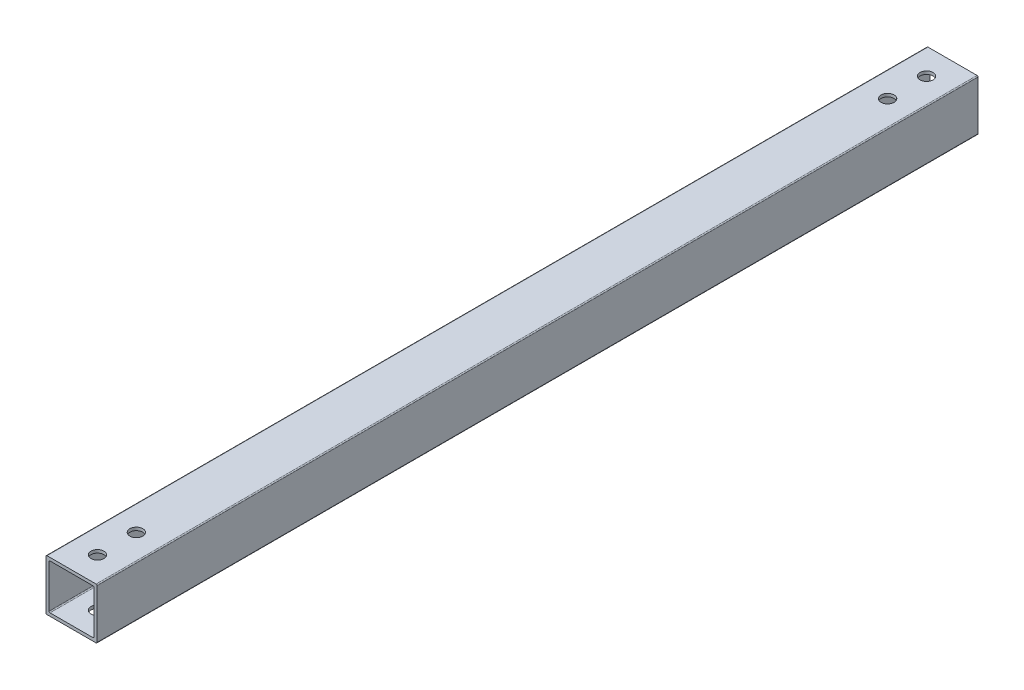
ISO-10303-21;
HEADER;
FILE_DESCRIPTION(('STEP AP214'),'2;1');
FILE_NAME('part.step','',(''),(''),'','','');
FILE_SCHEMA(('AUTOMOTIVE_DESIGN { 1 0 10303 214 1 1 1 1 }'));
ENDSEC;
DATA;
#1=APPLICATION_CONTEXT('core data for automotive mechanical design processes');
#2=APPLICATION_PROTOCOL_DEFINITION('international standard','automotive_design',2000,#1);
#3=PRODUCT_CONTEXT('',#1,'mechanical');
#4=PRODUCT('Part','Part','',(#3));
#5=PRODUCT_RELATED_PRODUCT_CATEGORY('part','',(#4));
#6=PRODUCT_DEFINITION_FORMATION('','',#4);
#7=PRODUCT_DEFINITION_CONTEXT('part definition',#1,'design');
#8=PRODUCT_DEFINITION('design','',#6,#7);
#9=PRODUCT_DEFINITION_SHAPE('','',#8);
#10=(LENGTH_UNIT() NAMED_UNIT(*) SI_UNIT(.MILLI.,.METRE.));
#11=(NAMED_UNIT(*) PLANE_ANGLE_UNIT() SI_UNIT($,.RADIAN.));
#12=(NAMED_UNIT(*) SI_UNIT($,.STERADIAN.) SOLID_ANGLE_UNIT());
#13=UNCERTAINTY_MEASURE_WITH_UNIT(LENGTH_MEASURE(1.E-05),#10,'distance_accuracy_value','');
#14=(GEOMETRIC_REPRESENTATION_CONTEXT(3) GLOBAL_UNCERTAINTY_ASSIGNED_CONTEXT((#13)) GLOBAL_UNIT_ASSIGNED_CONTEXT((#10,
#11,#12)) REPRESENTATION_CONTEXT('',''));
#15=CARTESIAN_POINT('',(0.,0.,0.));
#16=DIRECTION('',(0.,0.,1.));
#17=DIRECTION('',(1.,0.,0.));
#18=AXIS2_PLACEMENT_3D('',#15,#16,#17);
#19=CARTESIAN_POINT('',(-11.9999999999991,-11.9999999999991,-1568.6));
#20=DIRECTION('',(0.,0.,-1.));
#21=DIRECTION('',(-1.,0.,0.));
#22=AXIS2_PLACEMENT_3D('',#19,#20,#21);
#23=CYLINDRICAL_SURFACE('',#22,0.500000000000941);
#24=CARTESIAN_POINT('',(-11.9999999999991,-11.9999999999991,-2000.));
#25=DIRECTION('',(0.,0.,-1.));
#26=DIRECTION('',(-1.,0.,0.));
#27=AXIS2_PLACEMENT_3D('',#24,#25,#26);
#28=CIRCLE('',#27,0.500000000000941);
#29=CARTESIAN_POINT('',(-11.9999999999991,-12.5,-2000.));
#30=VERTEX_POINT('',#29);
#31=CARTESIAN_POINT('',(-12.5,-11.9999999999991,-2000.));
#32=VERTEX_POINT('',#31);
#33=EDGE_CURVE('E213',#30,#32,#28,.T.);
#34=ORIENTED_EDGE('',*,*,#33,.F.);
#35=DIRECTION('',(0.,0.,-1.));
#36=VECTOR('',#35,1.);
#37=CARTESIAN_POINT('',(-11.9999999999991,-12.5,-1568.6));
#38=LINE('',#37,#36);
#39=CARTESIAN_POINT('',(-11.9999999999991,-12.5,-1568.6));
#40=VERTEX_POINT('',#39);
#41=EDGE_CURVE('E11',#40,#30,#38,.T.);
#42=ORIENTED_EDGE('',*,*,#41,.F.);
#43=CARTESIAN_POINT('',(-11.9999999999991,-11.9999999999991,-1568.6));
#44=DIRECTION('',(0.,0.,-1.));
#45=DIRECTION('',(-1.,0.,0.));
#46=AXIS2_PLACEMENT_3D('',#43,#44,#45);
#47=CIRCLE('',#46,0.500000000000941);
#48=CARTESIAN_POINT('',(-12.5,-11.9999999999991,-1568.6));
#49=VERTEX_POINT('',#48);
#50=EDGE_CURVE('E225',#40,#49,#47,.T.);
#51=ORIENTED_EDGE('',*,*,#50,.T.);
#52=DIRECTION('',(0.,0.,-1.));
#53=VECTOR('',#52,1.);
#54=CARTESIAN_POINT('',(-12.5,-11.9999999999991,-1568.6));
#55=LINE('',#54,#53);
#56=EDGE_CURVE('E250',#49,#32,#55,.T.);
#57=ORIENTED_EDGE('',*,*,#56,.T.);
#58=EDGE_LOOP('',(#34,#42,#51,#57));
#59=FACE_BOUND('',#58,.T.);
#60=ADVANCED_FACE('F40',(#59),#23,.T.);
#61=CARTESIAN_POINT('',(11.9999999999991,-12.5,-1568.6));
#62=DIRECTION('',(0.,-1.,0.));
#63=DIRECTION('',(1.,0.,0.));
#64=AXIS2_PLACEMENT_3D('',#61,#62,#63);
#65=PLANE('',#64);
#66=CARTESIAN_POINT('',(0.,-12.5,-1987.3));
#67=DIRECTION('',(0.,-1.,0.));
#68=DIRECTION('',(1.,0.,0.));
#69=AXIS2_PLACEMENT_3D('',#66,#67,#68);
#70=CIRCLE('',#69,3.17500000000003);
#71=CARTESIAN_POINT('',(3.17500000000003,-12.5,-1987.3));
#72=VERTEX_POINT('',#71);
#73=EDGE_CURVE('E289',#72,#72,#70,.F.);
#74=ORIENTED_EDGE('',*,*,#73,.T.);
#75=EDGE_LOOP('',(#74));
#76=FACE_BOUND('',#75,.T.);
#77=CARTESIAN_POINT('',(0.,-12.5,-1968.25));
#78=DIRECTION('',(0.,-1.,0.));
#79=DIRECTION('',(1.,0.,0.));
#80=AXIS2_PLACEMENT_3D('',#77,#78,#79);
#81=CIRCLE('',#80,3.17500000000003);
#82=CARTESIAN_POINT('',(3.17500000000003,-12.5,-1968.25));
#83=VERTEX_POINT('',#82);
#84=EDGE_CURVE('E316',#83,#83,#81,.F.);
#85=ORIENTED_EDGE('',*,*,#84,.T.);
#86=EDGE_LOOP('',(#85));
#87=FACE_BOUND('',#86,.T.);
#88=CARTESIAN_POINT('',(0.,-12.5,-1600.35));
#89=DIRECTION('',(0.,-1.,0.));
#90=DIRECTION('',(1.,0.,0.));
#91=AXIS2_PLACEMENT_3D('',#88,#89,#90);
#92=CIRCLE('',#91,3.17500000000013);
#93=CARTESIAN_POINT('',(3.17500000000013,-12.5,-1600.35));
#94=VERTEX_POINT('',#93);
#95=EDGE_CURVE('E309',#94,#94,#92,.F.);
#96=ORIENTED_EDGE('',*,*,#95,.T.);
#97=EDGE_LOOP('',(#96));
#98=FACE_BOUND('',#97,.T.);
#99=CARTESIAN_POINT('',(0.,-12.5,-1581.3));
#100=DIRECTION('',(0.,-1.,0.));
#101=DIRECTION('',(1.,0.,0.));
#102=AXIS2_PLACEMENT_3D('',#99,#100,#101);
#103=CIRCLE('',#102,3.17500000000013);
#104=CARTESIAN_POINT('',(3.17500000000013,-12.5,-1581.3));
#105=VERTEX_POINT('',#104);
#106=EDGE_CURVE('E310',#105,#105,#103,.F.);
#107=ORIENTED_EDGE('',*,*,#106,.T.);
#108=EDGE_LOOP('',(#107));
#109=FACE_BOUND('',#108,.T.);
#110=DIRECTION('',(-1.,0.,0.));
#111=VECTOR('',#110,1.);
#112=CARTESIAN_POINT('',(11.9999999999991,-12.5,-2000.));
#113=LINE('',#112,#111);
#114=CARTESIAN_POINT('',(11.9999999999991,-12.5,-2000.));
#115=VERTEX_POINT('',#114);
#116=EDGE_CURVE('E229',#115,#30,#113,.T.);
#117=ORIENTED_EDGE('',*,*,#116,.F.);
#118=DIRECTION('',(0.,0.,-1.));
#119=VECTOR('',#118,1.);
#120=CARTESIAN_POINT('',(11.9999999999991,-12.5,-1568.6));
#121=LINE('',#120,#119);
#122=CARTESIAN_POINT('',(11.9999999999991,-12.5,-1568.6));
#123=VERTEX_POINT('',#122);
#124=EDGE_CURVE('E48',#123,#115,#121,.T.);
#125=ORIENTED_EDGE('',*,*,#124,.F.);
#126=DIRECTION('',(-1.,0.,0.));
#127=VECTOR('',#126,1.);
#128=CARTESIAN_POINT('',(11.9999999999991,-12.5,-1568.6));
#129=LINE('',#128,#127);
#130=EDGE_CURVE('E247',#123,#40,#129,.T.);
#131=ORIENTED_EDGE('',*,*,#130,.T.);
#132=ORIENTED_EDGE('',*,*,#41,.T.);
#133=EDGE_LOOP('',(#117,#125,#131,#132));
#134=FACE_BOUND('',#133,.T.);
#135=ADVANCED_FACE('F365',(#76,#87,#98,#109,#134),#65,.T.);
#136=CARTESIAN_POINT('',(11.9999999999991,-11.9999999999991,-1568.6));
#137=DIRECTION('',(0.,0.,-1.));
#138=DIRECTION('',(-1.,0.,0.));
#139=AXIS2_PLACEMENT_3D('',#136,#137,#138);
#140=CYLINDRICAL_SURFACE('',#139,0.500000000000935);
#141=CARTESIAN_POINT('',(11.9999999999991,-11.9999999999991,-2000.));
#142=DIRECTION('',(0.,0.,-1.));
#143=DIRECTION('',(-1.,0.,0.));
#144=AXIS2_PLACEMENT_3D('',#141,#142,#143);
#145=CIRCLE('',#144,0.500000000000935);
#146=CARTESIAN_POINT('',(12.5,-11.9999999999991,-2000.));
#147=VERTEX_POINT('',#146);
#148=EDGE_CURVE('E268',#147,#115,#145,.T.);
#149=ORIENTED_EDGE('',*,*,#148,.F.);
#150=DIRECTION('',(0.,0.,-1.));
#151=VECTOR('',#150,1.);
#152=CARTESIAN_POINT('',(12.5,-11.9999999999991,-1568.6));
#153=LINE('',#152,#151);
#154=CARTESIAN_POINT('',(12.5,-11.9999999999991,-1568.6));
#155=VERTEX_POINT('',#154);
#156=EDGE_CURVE('E274',#155,#147,#153,.T.);
#157=ORIENTED_EDGE('',*,*,#156,.F.);
#158=CARTESIAN_POINT('',(11.9999999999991,-11.9999999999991,-1568.6));
#159=DIRECTION('',(0.,0.,-1.));
#160=DIRECTION('',(-1.,0.,0.));
#161=AXIS2_PLACEMENT_3D('',#158,#159,#160);
#162=CIRCLE('',#161,0.500000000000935);
#163=EDGE_CURVE('E244',#155,#123,#162,.T.);
#164=ORIENTED_EDGE('',*,*,#163,.T.);
#165=ORIENTED_EDGE('',*,*,#124,.T.);
#166=EDGE_LOOP('',(#149,#157,#164,#165));
#167=FACE_BOUND('',#166,.T.);
#168=ADVANCED_FACE('F368',(#167),#140,.T.);
#169=CARTESIAN_POINT('',(12.5,11.9999999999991,-1568.6));
#170=DIRECTION('',(1.,0.,0.));
#171=DIRECTION('',(0.,1.,0.));
#172=AXIS2_PLACEMENT_3D('',#169,#170,#171);
#173=PLANE('',#172);
#174=DIRECTION('',(0.,-1.,0.));
#175=VECTOR('',#174,1.);
#176=CARTESIAN_POINT('',(12.5,11.9999999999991,-2000.));
#177=LINE('',#176,#175);
#178=CARTESIAN_POINT('',(12.5,11.9999999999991,-2000.));
#179=VERTEX_POINT('',#178);
#180=EDGE_CURVE('E265',#179,#147,#177,.T.);
#181=ORIENTED_EDGE('',*,*,#180,.F.);
#182=DIRECTION('',(0.,0.,-1.));
#183=VECTOR('',#182,1.);
#184=CARTESIAN_POINT('',(12.5,11.9999999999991,-1568.6));
#185=LINE('',#184,#183);
#186=CARTESIAN_POINT('',(12.5,11.9999999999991,-1568.6));
#187=VERTEX_POINT('',#186);
#188=EDGE_CURVE('E276',#187,#179,#185,.T.);
#189=ORIENTED_EDGE('',*,*,#188,.F.);
#190=DIRECTION('',(0.,-1.,0.));
#191=VECTOR('',#190,1.);
#192=CARTESIAN_POINT('',(12.5,11.9999999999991,-1568.6));
#193=LINE('',#192,#191);
#194=EDGE_CURVE('E241',#187,#155,#193,.T.);
#195=ORIENTED_EDGE('',*,*,#194,.T.);
#196=ORIENTED_EDGE('',*,*,#156,.T.);
#197=EDGE_LOOP('',(#181,#189,#195,#196));
#198=FACE_BOUND('',#197,.T.);
#199=ADVANCED_FACE('F372',(#198),#173,.T.);
#200=CARTESIAN_POINT('',(11.9999999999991,11.9999999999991,-1568.6));
#201=DIRECTION('',(0.,0.,-1.));
#202=DIRECTION('',(-1.,0.,0.));
#203=AXIS2_PLACEMENT_3D('',#200,#201,#202);
#204=CYLINDRICAL_SURFACE('',#203,0.500000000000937);
#205=CARTESIAN_POINT('',(11.9999999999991,11.9999999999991,-2000.));
#206=DIRECTION('',(0.,0.,-1.));
#207=DIRECTION('',(-1.,0.,0.));
#208=AXIS2_PLACEMENT_3D('',#205,#206,#207);
#209=CIRCLE('',#208,0.500000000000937);
#210=CARTESIAN_POINT('',(11.9999999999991,12.5,-2000.));
#211=VERTEX_POINT('',#210);
#212=EDGE_CURVE('E262',#211,#179,#209,.T.);
#213=ORIENTED_EDGE('',*,*,#212,.F.);
#214=DIRECTION('',(0.,0.,-1.));
#215=VECTOR('',#214,1.);
#216=CARTESIAN_POINT('',(11.9999999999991,12.5,-1568.6));
#217=LINE('',#216,#215);
#218=CARTESIAN_POINT('',(11.9999999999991,12.5,-1568.6));
#219=VERTEX_POINT('',#218);
#220=EDGE_CURVE('E278',#219,#211,#217,.T.);
#221=ORIENTED_EDGE('',*,*,#220,.F.);
#222=CARTESIAN_POINT('',(11.9999999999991,11.9999999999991,-1568.6));
#223=DIRECTION('',(0.,0.,-1.));
#224=DIRECTION('',(-1.,0.,0.));
#225=AXIS2_PLACEMENT_3D('',#222,#223,#224);
#226=CIRCLE('',#225,0.500000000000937);
#227=EDGE_CURVE('E238',#219,#187,#226,.T.);
#228=ORIENTED_EDGE('',*,*,#227,.T.);
#229=ORIENTED_EDGE('',*,*,#188,.T.);
#230=EDGE_LOOP('',(#213,#221,#228,#229));
#231=FACE_BOUND('',#230,.T.);
#232=ADVANCED_FACE('F337',(#231),#204,.T.);
#233=CARTESIAN_POINT('',(-11.9999999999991,12.5,-1568.6));
#234=DIRECTION('',(0.,1.,0.));
#235=DIRECTION('',(-1.,0.,0.));
#236=AXIS2_PLACEMENT_3D('',#233,#234,#235);
#237=PLANE('',#236);
#238=CARTESIAN_POINT('',(0.,12.5,-1987.3));
#239=DIRECTION('',(0.,1.,0.));
#240=DIRECTION('',(-1.,0.,0.));
#241=AXIS2_PLACEMENT_3D('',#238,#239,#240);
#242=CIRCLE('',#241,3.17500000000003);
#243=CARTESIAN_POINT('',(-3.17500000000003,12.5,-1987.3));
#244=VERTEX_POINT('',#243);
#245=EDGE_CURVE('E322',#244,#244,#242,.T.);
#246=ORIENTED_EDGE('',*,*,#245,.F.);
#247=EDGE_LOOP('',(#246));
#248=FACE_BOUND('',#247,.T.);
#249=CARTESIAN_POINT('',(0.,12.5,-1968.25));
#250=DIRECTION('',(0.,1.,0.));
#251=DIRECTION('',(-1.,0.,0.));
#252=AXIS2_PLACEMENT_3D('',#249,#250,#251);
#253=CIRCLE('',#252,3.17500000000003);
#254=CARTESIAN_POINT('',(-3.17500000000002,12.5,-1968.25));
#255=VERTEX_POINT('',#254);
#256=EDGE_CURVE('E319',#255,#255,#253,.T.);
#257=ORIENTED_EDGE('',*,*,#256,.F.);
#258=EDGE_LOOP('',(#257));
#259=FACE_BOUND('',#258,.T.);
#260=CARTESIAN_POINT('',(0.,12.5,-1600.35));
#261=DIRECTION('',(0.,1.,0.));
#262=DIRECTION('',(1.,0.,0.));
#263=AXIS2_PLACEMENT_3D('',#260,#261,#262);
#264=CIRCLE('',#263,3.17500000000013);
#265=CARTESIAN_POINT('',(3.17500000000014,12.5,-1600.35));
#266=VERTEX_POINT('',#265);
#267=EDGE_CURVE('E313',#266,#266,#264,.T.);
#268=ORIENTED_EDGE('',*,*,#267,.F.);
#269=EDGE_LOOP('',(#268));
#270=FACE_BOUND('',#269,.T.);
#271=CARTESIAN_POINT('',(0.,12.5,-1581.3));
#272=DIRECTION('',(0.,1.,0.));
#273=DIRECTION('',(1.,0.,0.));
#274=AXIS2_PLACEMENT_3D('',#271,#272,#273);
#275=CIRCLE('',#274,3.17500000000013);
#276=CARTESIAN_POINT('',(3.17500000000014,12.5,-1581.3));
#277=VERTEX_POINT('',#276);
#278=EDGE_CURVE('E306',#277,#277,#275,.T.);
#279=ORIENTED_EDGE('',*,*,#278,.F.);
#280=EDGE_LOOP('',(#279));
#281=FACE_BOUND('',#280,.T.);
#282=DIRECTION('',(1.,0.,0.));
#283=VECTOR('',#282,1.);
#284=CARTESIAN_POINT('',(-11.9999999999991,12.5,-2000.));
#285=LINE('',#284,#283);
#286=CARTESIAN_POINT('',(-11.9999999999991,12.5,-2000.));
#287=VERTEX_POINT('',#286);
#288=EDGE_CURVE('E259',#287,#211,#285,.T.);
#289=ORIENTED_EDGE('',*,*,#288,.F.);
#290=DIRECTION('',(0.,0.,-1.));
#291=VECTOR('',#290,1.);
#292=CARTESIAN_POINT('',(-11.9999999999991,12.5,-1568.6));
#293=LINE('',#292,#291);
#294=CARTESIAN_POINT('',(-11.9999999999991,12.5,-1568.6));
#295=VERTEX_POINT('',#294);
#296=EDGE_CURVE('E280',#295,#287,#293,.T.);
#297=ORIENTED_EDGE('',*,*,#296,.F.);
#298=DIRECTION('',(1.,0.,0.));
#299=VECTOR('',#298,1.);
#300=CARTESIAN_POINT('',(-11.9999999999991,12.5,-1568.6));
#301=LINE('',#300,#299);
#302=EDGE_CURVE('E235',#295,#219,#301,.T.);
#303=ORIENTED_EDGE('',*,*,#302,.T.);
#304=ORIENTED_EDGE('',*,*,#220,.T.);
#305=EDGE_LOOP('',(#289,#297,#303,#304));
#306=FACE_BOUND('',#305,.T.);
#307=ADVANCED_FACE('F333',(#248,#259,#270,#281,#306),#237,.T.);
#308=CARTESIAN_POINT('',(-11.9999999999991,11.9999999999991,-1568.6));
#309=DIRECTION('',(0.,0.,-1.));
#310=DIRECTION('',(-1.,0.,0.));
#311=AXIS2_PLACEMENT_3D('',#308,#309,#310);
#312=CYLINDRICAL_SURFACE('',#311,0.500000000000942);
#313=CARTESIAN_POINT('',(-11.9999999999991,11.9999999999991,-2000.));
#314=DIRECTION('',(0.,0.,-1.));
#315=DIRECTION('',(-1.,0.,0.));
#316=AXIS2_PLACEMENT_3D('',#313,#314,#315);
#317=CIRCLE('',#316,0.500000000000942);
#318=CARTESIAN_POINT('',(-12.5,11.9999999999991,-2000.));
#319=VERTEX_POINT('',#318);
#320=EDGE_CURVE('E256',#319,#287,#317,.T.);
#321=ORIENTED_EDGE('',*,*,#320,.F.);
#322=DIRECTION('',(0.,0.,-1.));
#323=VECTOR('',#322,1.);
#324=CARTESIAN_POINT('',(-12.5,11.9999999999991,-1568.6));
#325=LINE('',#324,#323);
#326=CARTESIAN_POINT('',(-12.5,11.9999999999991,-1568.6));
#327=VERTEX_POINT('',#326);
#328=EDGE_CURVE('E282',#327,#319,#325,.T.);
#329=ORIENTED_EDGE('',*,*,#328,.F.);
#330=CARTESIAN_POINT('',(-11.9999999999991,11.9999999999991,-1568.6));
#331=DIRECTION('',(0.,0.,-1.));
#332=DIRECTION('',(-1.,0.,0.));
#333=AXIS2_PLACEMENT_3D('',#330,#331,#332);
#334=CIRCLE('',#333,0.500000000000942);
#335=EDGE_CURVE('E232',#327,#295,#334,.T.);
#336=ORIENTED_EDGE('',*,*,#335,.T.);
#337=ORIENTED_EDGE('',*,*,#296,.T.);
#338=EDGE_LOOP('',(#321,#329,#336,#337));
#339=FACE_BOUND('',#338,.T.);
#340=ADVANCED_FACE('F336',(#339),#312,.T.);
#341=CARTESIAN_POINT('',(-12.5,-11.9999999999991,-1568.6));
#342=DIRECTION('',(-1.,0.,0.));
#343=DIRECTION('',(0.,0.,1.));
#344=AXIS2_PLACEMENT_3D('',#341,#342,#343);
#345=PLANE('',#344);
#346=DIRECTION('',(0.,1.,0.));
#347=VECTOR('',#346,1.);
#348=CARTESIAN_POINT('',(-12.5,-11.9999999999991,-2000.));
#349=LINE('',#348,#347);
#350=EDGE_CURVE('E253',#32,#319,#349,.T.);
#351=ORIENTED_EDGE('',*,*,#350,.F.);
#352=ORIENTED_EDGE('',*,*,#56,.F.);
#353=DIRECTION('',(0.,1.,0.));
#354=VECTOR('',#353,1.);
#355=CARTESIAN_POINT('',(-12.5,-11.9999999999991,-1568.6));
#356=LINE('',#355,#354);
#357=EDGE_CURVE('E228',#49,#327,#356,.T.);
#358=ORIENTED_EDGE('',*,*,#357,.T.);
#359=ORIENTED_EDGE('',*,*,#328,.T.);
#360=EDGE_LOOP('',(#351,#352,#358,#359));
#361=FACE_BOUND('',#360,.T.);
#362=ADVANCED_FACE('F358',(#361),#345,.T.);
#363=CARTESIAN_POINT('',(-11.9999999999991,-11.9999999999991,-1568.6));
#364=DIRECTION('',(0.,0.,-1.));
#365=DIRECTION('',(-1.,0.,0.));
#366=AXIS2_PLACEMENT_3D('',#363,#364,#365);
#367=PLANE('',#366);
#368=DIRECTION('',(0.,1.,0.));
#369=VECTOR('',#368,1.);
#370=CARTESIAN_POINT('',(-11.,10.4999999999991,-1568.6));
#371=LINE('',#370,#369);
#372=CARTESIAN_POINT('',(-11.,-10.4999999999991,-1568.6));
#373=VERTEX_POINT('',#372);
#374=CARTESIAN_POINT('',(-11.,10.4999999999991,-1568.6));
#375=VERTEX_POINT('',#374);
#376=EDGE_CURVE('E161',#373,#375,#371,.T.);
#377=ORIENTED_EDGE('',*,*,#376,.T.);
#378=CARTESIAN_POINT('',(-10.4999999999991,10.4999999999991,-1568.6));
#379=DIRECTION('',(0.,0.,-1.));
#380=DIRECTION('',(1.,0.,0.));
#381=AXIS2_PLACEMENT_3D('',#378,#379,#380);
#382=CIRCLE('',#381,0.500000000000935);
#383=CARTESIAN_POINT('',(-10.4999999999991,11.,-1568.6));
#384=VERTEX_POINT('',#383);
#385=EDGE_CURVE('E155',#375,#384,#382,.T.);
#386=ORIENTED_EDGE('',*,*,#385,.T.);
#387=DIRECTION('',(1.,0.,0.));
#388=VECTOR('',#387,1.);
#389=CARTESIAN_POINT('',(10.4999999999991,11.,-1568.6));
#390=LINE('',#389,#388);
#391=CARTESIAN_POINT('',(10.4999999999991,11.,-1568.6));
#392=VERTEX_POINT('',#391);
#393=EDGE_CURVE('E164',#384,#392,#390,.T.);
#394=ORIENTED_EDGE('',*,*,#393,.T.);
#395=CARTESIAN_POINT('',(10.4999999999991,10.4999999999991,-1568.6));
#396=DIRECTION('',(0.,0.,-1.));
#397=DIRECTION('',(1.,0.,0.));
#398=AXIS2_PLACEMENT_3D('',#395,#396,#397);
#399=CIRCLE('',#398,0.500000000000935);
#400=CARTESIAN_POINT('',(11.,10.4999999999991,-1568.6));
#401=VERTEX_POINT('',#400);
#402=EDGE_CURVE('E56',#392,#401,#399,.T.);
#403=ORIENTED_EDGE('',*,*,#402,.T.);
#404=DIRECTION('',(0.,-1.,0.));
#405=VECTOR('',#404,1.);
#406=CARTESIAN_POINT('',(11.,-10.4999999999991,-1568.6));
#407=LINE('',#406,#405);
#408=CARTESIAN_POINT('',(11.,-10.4999999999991,-1568.6));
#409=VERTEX_POINT('',#408);
#410=EDGE_CURVE('E182',#401,#409,#407,.T.);
#411=ORIENTED_EDGE('',*,*,#410,.T.);
#412=CARTESIAN_POINT('',(10.4999999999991,-10.4999999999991,-1568.6));
#413=DIRECTION('',(0.,0.,-1.));
#414=DIRECTION('',(1.,0.,0.));
#415=AXIS2_PLACEMENT_3D('',#412,#413,#414);
#416=CIRCLE('',#415,0.500000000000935);
#417=CARTESIAN_POINT('',(10.4999999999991,-11.,-1568.6));
#418=VERTEX_POINT('',#417);
#419=EDGE_CURVE('E185',#409,#418,#416,.T.);
#420=ORIENTED_EDGE('',*,*,#419,.T.);
#421=DIRECTION('',(-1.,0.,0.));
#422=VECTOR('',#421,1.);
#423=CARTESIAN_POINT('',(-10.4999999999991,-11.,-1568.6));
#424=LINE('',#423,#422);
#425=CARTESIAN_POINT('',(-10.4999999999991,-11.,-1568.6));
#426=VERTEX_POINT('',#425);
#427=EDGE_CURVE('E188',#418,#426,#424,.T.);
#428=ORIENTED_EDGE('',*,*,#427,.T.);
#429=CARTESIAN_POINT('',(-10.4999999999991,-10.4999999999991,-1568.6));
#430=DIRECTION('',(0.,0.,-1.));
#431=DIRECTION('',(1.,0.,0.));
#432=AXIS2_PLACEMENT_3D('',#429,#430,#431);
#433=CIRCLE('',#432,0.500000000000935);
#434=EDGE_CURVE('E191',#426,#373,#433,.T.);
#435=ORIENTED_EDGE('',*,*,#434,.T.);
#436=EDGE_LOOP('',(#377,#386,#394,#403,#411,#420,#428,#435));
#437=FACE_BOUND('',#436,.T.);
#438=ORIENTED_EDGE('',*,*,#50,.F.);
#439=ORIENTED_EDGE('',*,*,#130,.F.);
#440=ORIENTED_EDGE('',*,*,#163,.F.);
#441=ORIENTED_EDGE('',*,*,#194,.F.);
#442=ORIENTED_EDGE('',*,*,#227,.F.);
#443=ORIENTED_EDGE('',*,*,#302,.F.);
#444=ORIENTED_EDGE('',*,*,#335,.F.);
#445=ORIENTED_EDGE('',*,*,#357,.F.);
#446=EDGE_LOOP('',(#438,#439,#440,#441,#442,#443,#444,#445));
#447=FACE_BOUND('',#446,.T.);
#448=ADVANCED_FACE('F168',(#437,#447),#367,.F.);
#449=CARTESIAN_POINT('',(-11.9999999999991,-11.9999999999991,-2000.));
#450=DIRECTION('',(0.,0.,-1.));
#451=DIRECTION('',(-1.,0.,0.));
#452=AXIS2_PLACEMENT_3D('',#449,#450,#451);
#453=PLANE('',#452);
#454=CARTESIAN_POINT('',(-10.4999999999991,10.4999999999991,-2000.));
#455=DIRECTION('',(0.,0.,-1.));
#456=DIRECTION('',(1.,0.,0.));
#457=AXIS2_PLACEMENT_3D('',#454,#455,#456);
#458=CIRCLE('',#457,0.500000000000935);
#459=CARTESIAN_POINT('',(-11.,10.4999999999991,-2000.));
#460=VERTEX_POINT('',#459);
#461=CARTESIAN_POINT('',(-10.4999999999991,11.,-2000.));
#462=VERTEX_POINT('',#461);
#463=EDGE_CURVE('E64',#460,#462,#458,.T.);
#464=ORIENTED_EDGE('',*,*,#463,.F.);
#465=DIRECTION('',(0.,1.,0.));
#466=VECTOR('',#465,1.);
#467=CARTESIAN_POINT('',(-11.,10.4999999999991,-2000.));
#468=LINE('',#467,#466);
#469=CARTESIAN_POINT('',(-11.,-10.4999999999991,-2000.));
#470=VERTEX_POINT('',#469);
#471=EDGE_CURVE('E172',#470,#460,#468,.T.);
#472=ORIENTED_EDGE('',*,*,#471,.F.);
#473=CARTESIAN_POINT('',(-10.4999999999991,-10.4999999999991,-2000.));
#474=DIRECTION('',(0.,0.,-1.));
#475=DIRECTION('',(1.,0.,0.));
#476=AXIS2_PLACEMENT_3D('',#473,#474,#475);
#477=CIRCLE('',#476,0.500000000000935);
#478=CARTESIAN_POINT('',(-10.4999999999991,-11.,-2000.));
#479=VERTEX_POINT('',#478);
#480=EDGE_CURVE('E175',#479,#470,#477,.T.);
#481=ORIENTED_EDGE('',*,*,#480,.F.);
#482=DIRECTION('',(-1.,0.,0.));
#483=VECTOR('',#482,1.);
#484=CARTESIAN_POINT('',(-10.4999999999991,-11.,-2000.));
#485=LINE('',#484,#483);
#486=CARTESIAN_POINT('',(10.4999999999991,-11.,-2000.));
#487=VERTEX_POINT('',#486);
#488=EDGE_CURVE('E206',#487,#479,#485,.T.);
#489=ORIENTED_EDGE('',*,*,#488,.F.);
#490=CARTESIAN_POINT('',(10.4999999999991,-10.4999999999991,-2000.));
#491=DIRECTION('',(0.,0.,-1.));
#492=DIRECTION('',(1.,0.,0.));
#493=AXIS2_PLACEMENT_3D('',#490,#491,#492);
#494=CIRCLE('',#493,0.500000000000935);
#495=CARTESIAN_POINT('',(11.,-10.4999999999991,-2000.));
#496=VERTEX_POINT('',#495);
#497=EDGE_CURVE('E203',#496,#487,#494,.T.);
#498=ORIENTED_EDGE('',*,*,#497,.F.);
#499=DIRECTION('',(0.,-1.,0.));
#500=VECTOR('',#499,1.);
#501=CARTESIAN_POINT('',(11.,-10.4999999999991,-2000.));
#502=LINE('',#501,#500);
#503=CARTESIAN_POINT('',(11.,10.4999999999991,-2000.));
#504=VERTEX_POINT('',#503);
#505=EDGE_CURVE('E200',#504,#496,#502,.T.);
#506=ORIENTED_EDGE('',*,*,#505,.F.);
#507=CARTESIAN_POINT('',(10.4999999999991,10.4999999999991,-2000.));
#508=DIRECTION('',(0.,0.,-1.));
#509=DIRECTION('',(1.,0.,0.));
#510=AXIS2_PLACEMENT_3D('',#507,#508,#509);
#511=CIRCLE('',#510,0.500000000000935);
#512=CARTESIAN_POINT('',(10.4999999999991,11.,-2000.));
#513=VERTEX_POINT('',#512);
#514=EDGE_CURVE('E197',#513,#504,#511,.T.);
#515=ORIENTED_EDGE('',*,*,#514,.F.);
#516=DIRECTION('',(1.,0.,0.));
#517=VECTOR('',#516,1.);
#518=CARTESIAN_POINT('',(10.4999999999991,11.,-2000.));
#519=LINE('',#518,#517);
#520=EDGE_CURVE('E195',#462,#513,#519,.T.);
#521=ORIENTED_EDGE('',*,*,#520,.F.);
#522=EDGE_LOOP('',(#464,#472,#481,#489,#498,#506,#515,#521));
#523=FACE_BOUND('',#522,.T.);
#524=ORIENTED_EDGE('',*,*,#33,.T.);
#525=ORIENTED_EDGE('',*,*,#350,.T.);
#526=ORIENTED_EDGE('',*,*,#320,.T.);
#527=ORIENTED_EDGE('',*,*,#288,.T.);
#528=ORIENTED_EDGE('',*,*,#212,.T.);
#529=ORIENTED_EDGE('',*,*,#180,.T.);
#530=ORIENTED_EDGE('',*,*,#148,.T.);
#531=ORIENTED_EDGE('',*,*,#116,.T.);
#532=EDGE_LOOP('',(#524,#525,#526,#527,#528,#529,#530,#531));
#533=FACE_BOUND('',#532,.T.);
#534=ADVANCED_FACE('F350',(#523,#533),#453,.T.);
#535=CARTESIAN_POINT('',(-10.4999999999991,10.4999999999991,-1568.6));
#536=DIRECTION('',(0.,0.,-1.));
#537=DIRECTION('',(-1.,0.,0.));
#538=AXIS2_PLACEMENT_3D('',#535,#536,#537);
#539=CYLINDRICAL_SURFACE('',#538,0.500000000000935);
#540=ORIENTED_EDGE('',*,*,#463,.T.);
#541=DIRECTION('',(0.,0.,-1.));
#542=VECTOR('',#541,1.);
#543=CARTESIAN_POINT('',(-10.4999999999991,11.,-1568.6));
#544=LINE('',#543,#542);
#545=EDGE_CURVE('E151',#384,#462,#544,.T.);
#546=ORIENTED_EDGE('',*,*,#545,.F.);
#547=ORIENTED_EDGE('',*,*,#385,.F.);
#548=DIRECTION('',(0.,0.,-1.));
#549=VECTOR('',#548,1.);
#550=CARTESIAN_POINT('',(-11.,10.4999999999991,-1568.6));
#551=LINE('',#550,#549);
#552=EDGE_CURVE('E211',#375,#460,#551,.T.);
#553=ORIENTED_EDGE('',*,*,#552,.T.);
#554=EDGE_LOOP('',(#540,#546,#547,#553));
#555=FACE_BOUND('',#554,.T.);
#556=ADVANCED_FACE('F153',(#555),#539,.F.);
#557=CARTESIAN_POINT('',(-11.,10.4999999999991,-1568.6));
#558=DIRECTION('',(-1.,0.,0.));
#559=DIRECTION('',(0.,-1.,0.));
#560=AXIS2_PLACEMENT_3D('',#557,#558,#559);
#561=PLANE('',#560);
#562=ORIENTED_EDGE('',*,*,#471,.T.);
#563=ORIENTED_EDGE('',*,*,#552,.F.);
#564=ORIENTED_EDGE('',*,*,#376,.F.);
#565=DIRECTION('',(0.,0.,-1.));
#566=VECTOR('',#565,1.);
#567=CARTESIAN_POINT('',(-11.,-10.4999999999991,-1568.6));
#568=LINE('',#567,#566);
#569=EDGE_CURVE('E214',#373,#470,#568,.T.);
#570=ORIENTED_EDGE('',*,*,#569,.T.);
#571=EDGE_LOOP('',(#562,#563,#564,#570));
#572=FACE_BOUND('',#571,.T.);
#573=ADVANCED_FACE('F399',(#572),#561,.F.);
#574=CARTESIAN_POINT('',(-10.4999999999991,-10.4999999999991,-1568.6));
#575=DIRECTION('',(0.,0.,-1.));
#576=DIRECTION('',(-1.,0.,0.));
#577=AXIS2_PLACEMENT_3D('',#574,#575,#576);
#578=CYLINDRICAL_SURFACE('',#577,0.500000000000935);
#579=ORIENTED_EDGE('',*,*,#480,.T.);
#580=ORIENTED_EDGE('',*,*,#569,.F.);
#581=ORIENTED_EDGE('',*,*,#434,.F.);
#582=DIRECTION('',(0.,0.,-1.));
#583=VECTOR('',#582,1.);
#584=CARTESIAN_POINT('',(-10.4999999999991,-11.,-1568.6));
#585=LINE('',#584,#583);
#586=EDGE_CURVE('E216',#426,#479,#585,.T.);
#587=ORIENTED_EDGE('',*,*,#586,.T.);
#588=EDGE_LOOP('',(#579,#580,#581,#587));
#589=FACE_BOUND('',#588,.T.);
#590=ADVANCED_FACE('F418',(#589),#578,.F.);
#591=CARTESIAN_POINT('',(-10.4999999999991,-11.,-1568.6));
#592=DIRECTION('',(0.,-1.,0.));
#593=DIRECTION('',(0.,0.,-1.));
#594=AXIS2_PLACEMENT_3D('',#591,#592,#593);
#595=PLANE('',#594);
#596=CARTESIAN_POINT('',(0.,-11.,-1987.3));
#597=DIRECTION('',(0.,-1.,0.));
#598=DIRECTION('',(0.,0.,-1.));
#599=AXIS2_PLACEMENT_3D('',#596,#597,#598);
#600=CIRCLE('',#599,3.17500000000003);
#601=CARTESIAN_POINT('',(0.,-11.,-1990.475));
#602=VERTEX_POINT('',#601);
#603=EDGE_CURVE('E178',#602,#602,#600,.T.);
#604=ORIENTED_EDGE('',*,*,#603,.T.);
#605=EDGE_LOOP('',(#604));
#606=FACE_BOUND('',#605,.T.);
#607=CARTESIAN_POINT('',(0.,-11.,-1968.25));
#608=DIRECTION('',(0.,-1.,0.));
#609=DIRECTION('',(0.,0.,-1.));
#610=AXIS2_PLACEMENT_3D('',#607,#608,#609);
#611=CIRCLE('',#610,3.17500000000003);
#612=CARTESIAN_POINT('',(0.,-11.,-1971.425));
#613=VERTEX_POINT('',#612);
#614=EDGE_CURVE('E295',#613,#613,#611,.T.);
#615=ORIENTED_EDGE('',*,*,#614,.T.);
#616=EDGE_LOOP('',(#615));
#617=FACE_BOUND('',#616,.T.);
#618=CARTESIAN_POINT('',(0.,-11.,-1600.35));
#619=DIRECTION('',(0.,-1.,0.));
#620=DIRECTION('',(0.,0.,-1.));
#621=AXIS2_PLACEMENT_3D('',#618,#619,#620);
#622=CIRCLE('',#621,3.17500000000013);
#623=CARTESIAN_POINT('',(0.,-11.,-1603.525));
#624=VERTEX_POINT('',#623);
#625=EDGE_CURVE('E292',#624,#624,#622,.T.);
#626=ORIENTED_EDGE('',*,*,#625,.T.);
#627=EDGE_LOOP('',(#626));
#628=FACE_BOUND('',#627,.T.);
#629=CARTESIAN_POINT('',(0.,-11.,-1581.3));
#630=DIRECTION('',(0.,-1.,0.));
#631=DIRECTION('',(0.,0.,-1.));
#632=AXIS2_PLACEMENT_3D('',#629,#630,#631);
#633=CIRCLE('',#632,3.17500000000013);
#634=CARTESIAN_POINT('',(0.,-11.,-1584.475));
#635=VERTEX_POINT('',#634);
#636=EDGE_CURVE('E288',#635,#635,#633,.T.);
#637=ORIENTED_EDGE('',*,*,#636,.T.);
#638=EDGE_LOOP('',(#637));
#639=FACE_BOUND('',#638,.T.);
#640=ORIENTED_EDGE('',*,*,#488,.T.);
#641=ORIENTED_EDGE('',*,*,#586,.F.);
#642=ORIENTED_EDGE('',*,*,#427,.F.);
#643=DIRECTION('',(0.,0.,-1.));
#644=VECTOR('',#643,1.);
#645=CARTESIAN_POINT('',(10.4999999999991,-11.,-1568.6));
#646=LINE('',#645,#644);
#647=EDGE_CURVE('E218',#418,#487,#646,.T.);
#648=ORIENTED_EDGE('',*,*,#647,.T.);
#649=EDGE_LOOP('',(#640,#641,#642,#648));
#650=FACE_BOUND('',#649,.T.);
#651=ADVANCED_FACE('F414',(#606,#617,#628,#639,#650),#595,.F.);
#652=CARTESIAN_POINT('',(10.4999999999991,-10.4999999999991,-1568.6));
#653=DIRECTION('',(0.,0.,-1.));
#654=DIRECTION('',(-1.,0.,0.));
#655=AXIS2_PLACEMENT_3D('',#652,#653,#654);
#656=CYLINDRICAL_SURFACE('',#655,0.500000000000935);
#657=ORIENTED_EDGE('',*,*,#497,.T.);
#658=ORIENTED_EDGE('',*,*,#647,.F.);
#659=ORIENTED_EDGE('',*,*,#419,.F.);
#660=DIRECTION('',(0.,0.,-1.));
#661=VECTOR('',#660,1.);
#662=CARTESIAN_POINT('',(11.,-10.4999999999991,-1568.6));
#663=LINE('',#662,#661);
#664=EDGE_CURVE('E220',#409,#496,#663,.T.);
#665=ORIENTED_EDGE('',*,*,#664,.T.);
#666=EDGE_LOOP('',(#657,#658,#659,#665));
#667=FACE_BOUND('',#666,.T.);
#668=ADVANCED_FACE('F410',(#667),#656,.F.);
#669=CARTESIAN_POINT('',(11.,-10.4999999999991,-1568.6));
#670=DIRECTION('',(1.,0.,0.));
#671=DIRECTION('',(0.,0.,-1.));
#672=AXIS2_PLACEMENT_3D('',#669,#670,#671);
#673=PLANE('',#672);
#674=ORIENTED_EDGE('',*,*,#505,.T.);
#675=ORIENTED_EDGE('',*,*,#664,.F.);
#676=ORIENTED_EDGE('',*,*,#410,.F.);
#677=DIRECTION('',(0.,0.,-1.));
#678=VECTOR('',#677,1.);
#679=CARTESIAN_POINT('',(11.,10.4999999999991,-1568.6));
#680=LINE('',#679,#678);
#681=EDGE_CURVE('E222',#401,#504,#680,.T.);
#682=ORIENTED_EDGE('',*,*,#681,.T.);
#683=EDGE_LOOP('',(#674,#675,#676,#682));
#684=FACE_BOUND('',#683,.T.);
#685=ADVANCED_FACE('F407',(#684),#673,.F.);
#686=CARTESIAN_POINT('',(10.4999999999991,10.4999999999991,-1568.6));
#687=DIRECTION('',(0.,0.,-1.));
#688=DIRECTION('',(-1.,0.,0.));
#689=AXIS2_PLACEMENT_3D('',#686,#687,#688);
#690=CYLINDRICAL_SURFACE('',#689,0.500000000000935);
#691=ORIENTED_EDGE('',*,*,#514,.T.);
#692=ORIENTED_EDGE('',*,*,#681,.F.);
#693=ORIENTED_EDGE('',*,*,#402,.F.);
#694=DIRECTION('',(0.,0.,-1.));
#695=VECTOR('',#694,1.);
#696=CARTESIAN_POINT('',(10.4999999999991,11.,-1568.6));
#697=LINE('',#696,#695);
#698=EDGE_CURVE('E160',#392,#513,#697,.T.);
#699=ORIENTED_EDGE('',*,*,#698,.T.);
#700=EDGE_LOOP('',(#691,#692,#693,#699));
#701=FACE_BOUND('',#700,.T.);
#702=ADVANCED_FACE('F403',(#701),#690,.F.);
#703=CARTESIAN_POINT('',(10.4999999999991,11.,-1568.6));
#704=DIRECTION('',(0.,1.,0.));
#705=DIRECTION('',(-1.,0.,0.));
#706=AXIS2_PLACEMENT_3D('',#703,#704,#705);
#707=PLANE('',#706);
#708=CARTESIAN_POINT('',(0.,11.,-1987.3));
#709=DIRECTION('',(0.,1.,0.));
#710=DIRECTION('',(-1.,0.,0.));
#711=AXIS2_PLACEMENT_3D('',#708,#709,#710);
#712=CIRCLE('',#711,3.17500000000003);
#713=CARTESIAN_POINT('',(-3.17500000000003,11.,-1987.3));
#714=VERTEX_POINT('',#713);
#715=EDGE_CURVE('E43',#714,#714,#712,.T.);
#716=ORIENTED_EDGE('',*,*,#715,.T.);
#717=EDGE_LOOP('',(#716));
#718=FACE_BOUND('',#717,.T.);
#719=CARTESIAN_POINT('',(0.,11.,-1968.25));
#720=DIRECTION('',(0.,1.,0.));
#721=DIRECTION('',(-1.,0.,0.));
#722=AXIS2_PLACEMENT_3D('',#719,#720,#721);
#723=CIRCLE('',#722,3.17500000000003);
#724=CARTESIAN_POINT('',(-3.17500000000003,11.,-1968.25));
#725=VERTEX_POINT('',#724);
#726=EDGE_CURVE('E293',#725,#725,#723,.T.);
#727=ORIENTED_EDGE('',*,*,#726,.T.);
#728=EDGE_LOOP('',(#727));
#729=FACE_BOUND('',#728,.T.);
#730=CARTESIAN_POINT('',(0.,11.,-1600.35));
#731=DIRECTION('',(0.,1.,0.));
#732=DIRECTION('',(-1.,0.,0.));
#733=AXIS2_PLACEMENT_3D('',#730,#731,#732);
#734=CIRCLE('',#733,3.17500000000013);
#735=CARTESIAN_POINT('',(-3.17500000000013,11.,-1600.35));
#736=VERTEX_POINT('',#735);
#737=EDGE_CURVE('E290',#736,#736,#734,.T.);
#738=ORIENTED_EDGE('',*,*,#737,.T.);
#739=EDGE_LOOP('',(#738));
#740=FACE_BOUND('',#739,.T.);
#741=CARTESIAN_POINT('',(0.,11.,-1581.3));
#742=DIRECTION('',(0.,1.,0.));
#743=DIRECTION('',(-1.,0.,0.));
#744=AXIS2_PLACEMENT_3D('',#741,#742,#743);
#745=CIRCLE('',#744,3.17500000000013);
#746=CARTESIAN_POINT('',(-3.17500000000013,11.,-1581.3));
#747=VERTEX_POINT('',#746);
#748=EDGE_CURVE('E285',#747,#747,#745,.T.);
#749=ORIENTED_EDGE('',*,*,#748,.T.);
#750=EDGE_LOOP('',(#749));
#751=FACE_BOUND('',#750,.T.);
#752=ORIENTED_EDGE('',*,*,#520,.T.);
#753=ORIENTED_EDGE('',*,*,#698,.F.);
#754=ORIENTED_EDGE('',*,*,#393,.F.);
#755=ORIENTED_EDGE('',*,*,#545,.T.);
#756=EDGE_LOOP('',(#752,#753,#754,#755));
#757=FACE_BOUND('',#756,.T.);
#758=ADVANCED_FACE('F165',(#718,#729,#740,#751,#757),#707,.F.);
#759=CARTESIAN_POINT('',(0.,-21.4802561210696,-1581.3));
#760=DIRECTION('',(0.,1.,0.));
#761=DIRECTION('',(-1.,0.,0.));
#762=AXIS2_PLACEMENT_3D('',#759,#760,#761);
#763=CYLINDRICAL_SURFACE('',#762,3.17500000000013);
#764=ORIENTED_EDGE('',*,*,#278,.T.);
#765=EDGE_LOOP('',(#764));
#766=FACE_BOUND('',#765,.T.);
#767=ORIENTED_EDGE('',*,*,#748,.F.);
#768=EDGE_LOOP('',(#767));
#769=FACE_BOUND('',#768,.T.);
#770=ADVANCED_FACE('F402',(#766,#769),#763,.F.);
#771=CARTESIAN_POINT('',(0.,-21.4802561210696,-1600.35));
#772=DIRECTION('',(0.,1.,0.));
#773=DIRECTION('',(-1.,0.,0.));
#774=AXIS2_PLACEMENT_3D('',#771,#772,#773);
#775=CYLINDRICAL_SURFACE('',#774,3.17500000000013);
#776=ORIENTED_EDGE('',*,*,#267,.T.);
#777=EDGE_LOOP('',(#776));
#778=FACE_BOUND('',#777,.T.);
#779=ORIENTED_EDGE('',*,*,#737,.F.);
#780=EDGE_LOOP('',(#779));
#781=FACE_BOUND('',#780,.T.);
#782=ADVANCED_FACE('F435',(#778,#781),#775,.F.);
#783=CARTESIAN_POINT('',(0.,-21.4802561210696,-1968.25));
#784=DIRECTION('',(0.,1.,0.));
#785=DIRECTION('',(-1.,0.,0.));
#786=AXIS2_PLACEMENT_3D('',#783,#784,#785);
#787=CYLINDRICAL_SURFACE('',#786,3.17500000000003);
#788=ORIENTED_EDGE('',*,*,#256,.T.);
#789=EDGE_LOOP('',(#788));
#790=FACE_BOUND('',#789,.T.);
#791=ORIENTED_EDGE('',*,*,#726,.F.);
#792=EDGE_LOOP('',(#791));
#793=FACE_BOUND('',#792,.T.);
#794=ADVANCED_FACE('F440',(#790,#793),#787,.F.);
#795=CARTESIAN_POINT('',(0.,-21.4802561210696,-1987.3));
#796=DIRECTION('',(0.,1.,0.));
#797=DIRECTION('',(-1.,0.,0.));
#798=AXIS2_PLACEMENT_3D('',#795,#796,#797);
#799=CYLINDRICAL_SURFACE('',#798,3.17500000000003);
#800=ORIENTED_EDGE('',*,*,#245,.T.);
#801=EDGE_LOOP('',(#800));
#802=FACE_BOUND('',#801,.T.);
#803=ORIENTED_EDGE('',*,*,#715,.F.);
#804=EDGE_LOOP('',(#803));
#805=FACE_BOUND('',#804,.T.);
#806=ADVANCED_FACE('F330',(#802,#805),#799,.F.);
#807=ORIENTED_EDGE('',*,*,#106,.F.);
#808=EDGE_LOOP('',(#807));
#809=FACE_BOUND('',#808,.T.);
#810=ORIENTED_EDGE('',*,*,#636,.F.);
#811=EDGE_LOOP('',(#810));
#812=FACE_BOUND('',#811,.T.);
#813=ADVANCED_FACE('F426',(#809,#812),#763,.F.);
#814=ORIENTED_EDGE('',*,*,#95,.F.);
#815=EDGE_LOOP('',(#814));
#816=FACE_BOUND('',#815,.T.);
#817=ORIENTED_EDGE('',*,*,#625,.F.);
#818=EDGE_LOOP('',(#817));
#819=FACE_BOUND('',#818,.T.);
#820=ADVANCED_FACE('F429',(#816,#819),#775,.F.);
#821=ORIENTED_EDGE('',*,*,#84,.F.);
#822=EDGE_LOOP('',(#821));
#823=FACE_BOUND('',#822,.T.);
#824=ORIENTED_EDGE('',*,*,#614,.F.);
#825=EDGE_LOOP('',(#824));
#826=FACE_BOUND('',#825,.T.);
#827=ADVANCED_FACE('F433',(#823,#826),#787,.F.);
#828=ORIENTED_EDGE('',*,*,#73,.F.);
#829=EDGE_LOOP('',(#828));
#830=FACE_BOUND('',#829,.T.);
#831=ORIENTED_EDGE('',*,*,#603,.F.);
#832=EDGE_LOOP('',(#831));
#833=FACE_BOUND('',#832,.T.);
#834=ADVANCED_FACE('F438',(#830,#833),#799,.F.);
#835=CLOSED_SHELL('',(#60,#135,#168,#199,#232,#307,#340,#362,#448,#534,#556,#573,#590,#651,#668,
#685,#702,#758,#770,#782,#794,#806,#813,#820,#827,#834));
#836=MANIFOLD_SOLID_BREP('B2',#835);
#837=ADVANCED_BREP_SHAPE_REPRESENTATION('',(#18,#836),#14);
#838=SHAPE_DEFINITION_REPRESENTATION(#9,#837);
ENDSEC;
END-ISO-10303-21;
